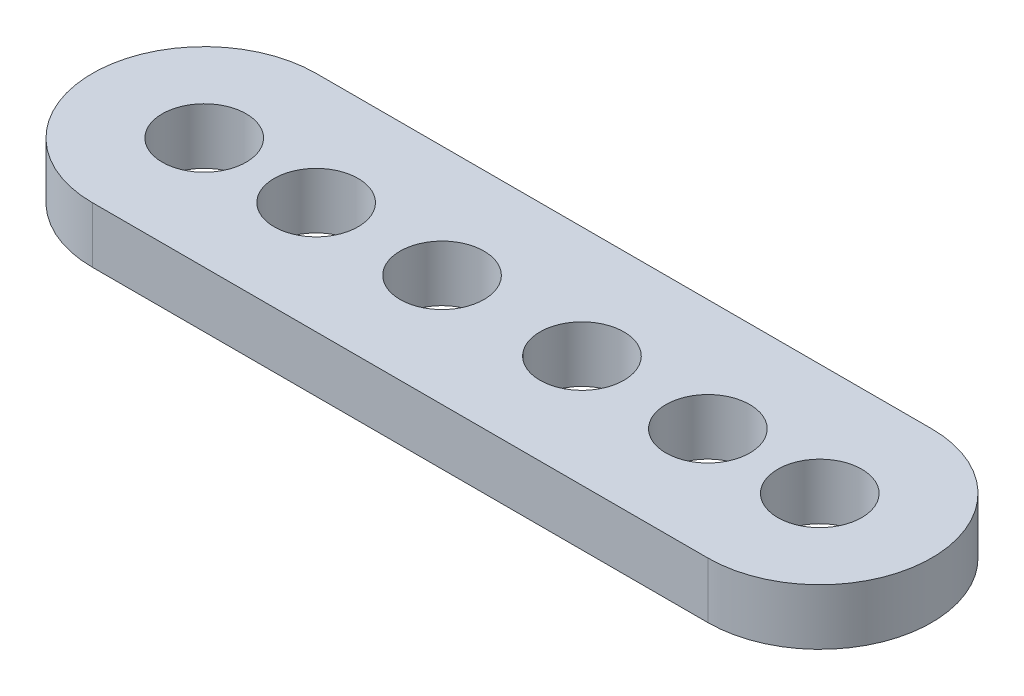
ISO-10303-21;
HEADER;
FILE_DESCRIPTION(('STEP AP214'),'2;1');
FILE_NAME('part.step','',(''),(''),'','','');
FILE_SCHEMA(('AUTOMOTIVE_DESIGN { 1 0 10303 214 1 1 1 1 }'));
ENDSEC;
DATA;
#1=APPLICATION_CONTEXT('core data for automotive mechanical design processes');
#2=APPLICATION_PROTOCOL_DEFINITION('international standard','automotive_design',2000,#1);
#3=PRODUCT_CONTEXT('',#1,'mechanical');
#4=PRODUCT('Part','Part','',(#3));
#5=PRODUCT_RELATED_PRODUCT_CATEGORY('part','',(#4));
#6=PRODUCT_DEFINITION_FORMATION('','',#4);
#7=PRODUCT_DEFINITION_CONTEXT('part definition',#1,'design');
#8=PRODUCT_DEFINITION('design','',#6,#7);
#9=PRODUCT_DEFINITION_SHAPE('','',#8);
#10=(LENGTH_UNIT() NAMED_UNIT(*) SI_UNIT(.MILLI.,.METRE.));
#11=(NAMED_UNIT(*) PLANE_ANGLE_UNIT() SI_UNIT($,.RADIAN.));
#12=(NAMED_UNIT(*) SI_UNIT($,.STERADIAN.) SOLID_ANGLE_UNIT());
#13=UNCERTAINTY_MEASURE_WITH_UNIT(LENGTH_MEASURE(1.E-05),#10,'distance_accuracy_value','');
#14=(GEOMETRIC_REPRESENTATION_CONTEXT(3) GLOBAL_UNCERTAINTY_ASSIGNED_CONTEXT((#13)) GLOBAL_UNIT_ASSIGNED_CONTEXT((#10,
#11,#12)) REPRESENTATION_CONTEXT('',''));
#15=CARTESIAN_POINT('',(0.,0.,0.));
#16=DIRECTION('',(0.,0.,1.));
#17=DIRECTION('',(1.,0.,0.));
#18=AXIS2_PLACEMENT_3D('',#15,#16,#17);
#19=CARTESIAN_POINT('',(0.,2.,0.));
#20=DIRECTION('',(0.,1.,0.));
#21=DIRECTION('',(0.,0.,1.));
#22=AXIS2_PLACEMENT_3D('',#19,#20,#21);
#23=PLANE('',#22);
#24=CARTESIAN_POINT('',(18.,2.,0.));
#25=DIRECTION('',(0.,1.,0.));
#26=DIRECTION('',(0.,0.,1.));
#27=AXIS2_PLACEMENT_3D('',#24,#25,#26);
#28=CIRCLE('',#27,1.5);
#29=CARTESIAN_POINT('',(18.,2.,1.5));
#30=VERTEX_POINT('',#29);
#31=EDGE_CURVE('E133',#30,#30,#28,.T.);
#32=ORIENTED_EDGE('',*,*,#31,.F.);
#33=EDGE_LOOP('',(#32));
#34=FACE_BOUND('',#33,.T.);
#35=CARTESIAN_POINT('',(8.5,2.,0.));
#36=DIRECTION('',(0.,1.,0.));
#37=DIRECTION('',(0.,0.,1.));
#38=AXIS2_PLACEMENT_3D('',#35,#36,#37);
#39=CIRCLE('',#38,1.5);
#40=CARTESIAN_POINT('',(8.5,2.,1.5));
#41=VERTEX_POINT('',#40);
#42=EDGE_CURVE('E121',#41,#41,#39,.T.);
#43=ORIENTED_EDGE('',*,*,#42,.F.);
#44=EDGE_LOOP('',(#43));
#45=FACE_BOUND('',#44,.T.);
#46=CARTESIAN_POINT('',(0.,2.,0.));
#47=DIRECTION('',(0.,1.,0.));
#48=DIRECTION('',(0.,0.,1.));
#49=AXIS2_PLACEMENT_3D('',#46,#47,#48);
#50=CIRCLE('',#49,1.5);
#51=CARTESIAN_POINT('',(0.,2.,1.5));
#52=VERTEX_POINT('',#51);
#53=EDGE_CURVE('E100',#52,#52,#50,.T.);
#54=ORIENTED_EDGE('',*,*,#53,.F.);
#55=EDGE_LOOP('',(#54));
#56=FACE_BOUND('',#55,.T.);
#57=CARTESIAN_POINT('',(0.,2.,0.));
#58=DIRECTION('',(0.,1.,0.));
#59=DIRECTION('',(0.,0.,1.));
#60=AXIS2_PLACEMENT_3D('',#57,#58,#59);
#61=CIRCLE('',#60,4.);
#62=CARTESIAN_POINT('',(0.,2.,-4.));
#63=VERTEX_POINT('',#62);
#64=CARTESIAN_POINT('',(0.,2.,4.));
#65=VERTEX_POINT('',#64);
#66=EDGE_CURVE('E85',#63,#65,#61,.T.);
#67=ORIENTED_EDGE('',*,*,#66,.T.);
#68=DIRECTION('',(1.,0.,0.));
#69=VECTOR('',#68,1.);
#70=CARTESIAN_POINT('',(0.,2.,4.));
#71=LINE('',#70,#69);
#72=CARTESIAN_POINT('',(22.,2.,4.));
#73=VERTEX_POINT('',#72);
#74=EDGE_CURVE('E80',#65,#73,#71,.T.);
#75=ORIENTED_EDGE('',*,*,#74,.T.);
#76=CARTESIAN_POINT('',(22.,2.,0.));
#77=DIRECTION('',(0.,1.,0.));
#78=DIRECTION('',(0.,0.,1.));
#79=AXIS2_PLACEMENT_3D('',#76,#77,#78);
#80=CIRCLE('',#79,4.);
#81=CARTESIAN_POINT('',(22.,2.,-4.));
#82=VERTEX_POINT('',#81);
#83=EDGE_CURVE('E83',#73,#82,#80,.T.);
#84=ORIENTED_EDGE('',*,*,#83,.T.);
#85=DIRECTION('',(-1.,0.,0.));
#86=VECTOR('',#85,1.);
#87=CARTESIAN_POINT('',(0.,2.,-4.));
#88=LINE('',#87,#86);
#89=EDGE_CURVE('E50',#82,#63,#88,.T.);
#90=ORIENTED_EDGE('',*,*,#89,.T.);
#91=EDGE_LOOP('',(#67,#75,#84,#90));
#92=FACE_BOUND('',#91,.T.);
#93=CARTESIAN_POINT('',(4.,2.,0.));
#94=DIRECTION('',(0.,1.,0.));
#95=DIRECTION('',(0.,0.,1.));
#96=AXIS2_PLACEMENT_3D('',#93,#94,#95);
#97=CIRCLE('',#96,1.5);
#98=CARTESIAN_POINT('',(4.,2.,1.5));
#99=VERTEX_POINT('',#98);
#100=EDGE_CURVE('E115',#99,#99,#97,.T.);
#101=ORIENTED_EDGE('',*,*,#100,.F.);
#102=EDGE_LOOP('',(#101));
#103=FACE_BOUND('',#102,.T.);
#104=CARTESIAN_POINT('',(13.5,2.,0.));
#105=DIRECTION('',(0.,1.,0.));
#106=DIRECTION('',(0.,0.,1.));
#107=AXIS2_PLACEMENT_3D('',#104,#105,#106);
#108=CIRCLE('',#107,1.5);
#109=CARTESIAN_POINT('',(13.5,2.,1.5));
#110=VERTEX_POINT('',#109);
#111=EDGE_CURVE('E127',#110,#110,#108,.T.);
#112=ORIENTED_EDGE('',*,*,#111,.F.);
#113=EDGE_LOOP('',(#112));
#114=FACE_BOUND('',#113,.T.);
#115=CARTESIAN_POINT('',(22.,2.,0.));
#116=DIRECTION('',(0.,1.,0.));
#117=DIRECTION('',(0.,0.,1.));
#118=AXIS2_PLACEMENT_3D('',#115,#116,#117);
#119=CIRCLE('',#118,1.5);
#120=CARTESIAN_POINT('',(22.,2.,1.5));
#121=VERTEX_POINT('',#120);
#122=EDGE_CURVE('E139',#121,#121,#119,.T.);
#123=ORIENTED_EDGE('',*,*,#122,.F.);
#124=EDGE_LOOP('',(#123));
#125=FACE_BOUND('',#124,.T.);
#126=ADVANCED_FACE('F33',(#34,#45,#56,#92,#103,#114,#125),#23,.T.);
#127=CARTESIAN_POINT('',(0.,0.,0.));
#128=DIRECTION('',(0.,1.,0.));
#129=DIRECTION('',(0.,0.,1.));
#130=AXIS2_PLACEMENT_3D('',#127,#128,#129);
#131=PLANE('',#130);
#132=CARTESIAN_POINT('',(0.,0.,0.));
#133=DIRECTION('',(0.,1.,0.));
#134=DIRECTION('',(0.,0.,1.));
#135=AXIS2_PLACEMENT_3D('',#132,#133,#134);
#136=CIRCLE('',#135,4.);
#137=CARTESIAN_POINT('',(0.,0.,-4.));
#138=VERTEX_POINT('',#137);
#139=CARTESIAN_POINT('',(0.,0.,4.));
#140=VERTEX_POINT('',#139);
#141=EDGE_CURVE('E97',#138,#140,#136,.T.);
#142=ORIENTED_EDGE('',*,*,#141,.F.);
#143=DIRECTION('',(-1.,0.,0.));
#144=VECTOR('',#143,1.);
#145=CARTESIAN_POINT('',(0.,0.,-4.));
#146=LINE('',#145,#144);
#147=CARTESIAN_POINT('',(22.,0.,-4.));
#148=VERTEX_POINT('',#147);
#149=EDGE_CURVE('E73',#148,#138,#146,.T.);
#150=ORIENTED_EDGE('',*,*,#149,.F.);
#151=CARTESIAN_POINT('',(22.,0.,0.));
#152=DIRECTION('',(0.,1.,0.));
#153=DIRECTION('',(0.,0.,1.));
#154=AXIS2_PLACEMENT_3D('',#151,#152,#153);
#155=CIRCLE('',#154,4.);
#156=CARTESIAN_POINT('',(22.,0.,4.));
#157=VERTEX_POINT('',#156);
#158=EDGE_CURVE('E67',#157,#148,#155,.T.);
#159=ORIENTED_EDGE('',*,*,#158,.F.);
#160=DIRECTION('',(1.,0.,0.));
#161=VECTOR('',#160,1.);
#162=CARTESIAN_POINT('',(0.,0.,4.));
#163=LINE('',#162,#161);
#164=EDGE_CURVE('E89',#140,#157,#163,.T.);
#165=ORIENTED_EDGE('',*,*,#164,.F.);
#166=EDGE_LOOP('',(#142,#150,#159,#165));
#167=FACE_BOUND('',#166,.T.);
#168=CARTESIAN_POINT('',(0.,0.,0.));
#169=DIRECTION('',(0.,1.,0.));
#170=DIRECTION('',(0.,0.,1.));
#171=AXIS2_PLACEMENT_3D('',#168,#169,#170);
#172=CIRCLE('',#171,1.5);
#173=CARTESIAN_POINT('',(0.,0.,1.5));
#174=VERTEX_POINT('',#173);
#175=EDGE_CURVE('E112',#174,#174,#172,.T.);
#176=ORIENTED_EDGE('',*,*,#175,.T.);
#177=EDGE_LOOP('',(#176));
#178=FACE_BOUND('',#177,.T.);
#179=CARTESIAN_POINT('',(4.,0.,0.));
#180=DIRECTION('',(0.,1.,0.));
#181=DIRECTION('',(0.,0.,1.));
#182=AXIS2_PLACEMENT_3D('',#179,#180,#181);
#183=CIRCLE('',#182,1.5);
#184=CARTESIAN_POINT('',(4.,0.,1.5));
#185=VERTEX_POINT('',#184);
#186=EDGE_CURVE('E118',#185,#185,#183,.T.);
#187=ORIENTED_EDGE('',*,*,#186,.T.);
#188=EDGE_LOOP('',(#187));
#189=FACE_BOUND('',#188,.T.);
#190=CARTESIAN_POINT('',(8.5,0.,0.));
#191=DIRECTION('',(0.,1.,0.));
#192=DIRECTION('',(0.,0.,1.));
#193=AXIS2_PLACEMENT_3D('',#190,#191,#192);
#194=CIRCLE('',#193,1.5);
#195=CARTESIAN_POINT('',(8.5,0.,1.5));
#196=VERTEX_POINT('',#195);
#197=EDGE_CURVE('E124',#196,#196,#194,.T.);
#198=ORIENTED_EDGE('',*,*,#197,.T.);
#199=EDGE_LOOP('',(#198));
#200=FACE_BOUND('',#199,.T.);
#201=CARTESIAN_POINT('',(13.5,0.,0.));
#202=DIRECTION('',(0.,1.,0.));
#203=DIRECTION('',(0.,0.,1.));
#204=AXIS2_PLACEMENT_3D('',#201,#202,#203);
#205=CIRCLE('',#204,1.5);
#206=CARTESIAN_POINT('',(13.5,0.,1.5));
#207=VERTEX_POINT('',#206);
#208=EDGE_CURVE('E130',#207,#207,#205,.T.);
#209=ORIENTED_EDGE('',*,*,#208,.T.);
#210=EDGE_LOOP('',(#209));
#211=FACE_BOUND('',#210,.T.);
#212=CARTESIAN_POINT('',(18.,0.,0.));
#213=DIRECTION('',(0.,1.,0.));
#214=DIRECTION('',(0.,0.,1.));
#215=AXIS2_PLACEMENT_3D('',#212,#213,#214);
#216=CIRCLE('',#215,1.5);
#217=CARTESIAN_POINT('',(18.,0.,1.5));
#218=VERTEX_POINT('',#217);
#219=EDGE_CURVE('E136',#218,#218,#216,.T.);
#220=ORIENTED_EDGE('',*,*,#219,.T.);
#221=EDGE_LOOP('',(#220));
#222=FACE_BOUND('',#221,.T.);
#223=CARTESIAN_POINT('',(22.,0.,0.));
#224=DIRECTION('',(0.,1.,0.));
#225=DIRECTION('',(0.,0.,1.));
#226=AXIS2_PLACEMENT_3D('',#223,#224,#225);
#227=CIRCLE('',#226,1.5);
#228=CARTESIAN_POINT('',(22.,0.,1.5));
#229=VERTEX_POINT('',#228);
#230=EDGE_CURVE('E142',#229,#229,#227,.T.);
#231=ORIENTED_EDGE('',*,*,#230,.T.);
#232=EDGE_LOOP('',(#231));
#233=FACE_BOUND('',#232,.T.);
#234=ADVANCED_FACE('F108',(#167,#178,#189,#200,#211,#222,#233),#131,.F.);
#235=CARTESIAN_POINT('',(0.,2.,0.));
#236=DIRECTION('',(0.,-1.,0.));
#237=DIRECTION('',(0.,0.,-1.));
#238=AXIS2_PLACEMENT_3D('',#235,#236,#237);
#239=CYLINDRICAL_SURFACE('',#238,4.);
#240=ORIENTED_EDGE('',*,*,#141,.T.);
#241=DIRECTION('',(0.,-1.,0.));
#242=VECTOR('',#241,1.);
#243=CARTESIAN_POINT('',(0.,2.,4.));
#244=LINE('',#243,#242);
#245=EDGE_CURVE('E11',#65,#140,#244,.T.);
#246=ORIENTED_EDGE('',*,*,#245,.F.);
#247=ORIENTED_EDGE('',*,*,#66,.F.);
#248=DIRECTION('',(0.,-1.,0.));
#249=VECTOR('',#248,1.);
#250=CARTESIAN_POINT('',(0.,2.,-4.));
#251=LINE('',#250,#249);
#252=EDGE_CURVE('E93',#63,#138,#251,.T.);
#253=ORIENTED_EDGE('',*,*,#252,.T.);
#254=EDGE_LOOP('',(#240,#246,#247,#253));
#255=FACE_BOUND('',#254,.T.);
#256=ADVANCED_FACE('F35',(#255),#239,.T.);
#257=CARTESIAN_POINT('',(0.,2.,4.));
#258=DIRECTION('',(0.,0.,-1.));
#259=DIRECTION('',(-1.,0.,0.));
#260=AXIS2_PLACEMENT_3D('',#257,#258,#259);
#261=PLANE('',#260);
#262=ORIENTED_EDGE('',*,*,#164,.T.);
#263=DIRECTION('',(0.,-1.,0.));
#264=VECTOR('',#263,1.);
#265=CARTESIAN_POINT('',(22.,2.,4.));
#266=LINE('',#265,#264);
#267=EDGE_CURVE('E42',#73,#157,#266,.T.);
#268=ORIENTED_EDGE('',*,*,#267,.F.);
#269=ORIENTED_EDGE('',*,*,#74,.F.);
#270=ORIENTED_EDGE('',*,*,#245,.T.);
#271=EDGE_LOOP('',(#262,#268,#269,#270));
#272=FACE_BOUND('',#271,.T.);
#273=ADVANCED_FACE('F88',(#272),#261,.F.);
#274=CARTESIAN_POINT('',(22.,2.,0.));
#275=DIRECTION('',(0.,-1.,0.));
#276=DIRECTION('',(0.,0.,-1.));
#277=AXIS2_PLACEMENT_3D('',#274,#275,#276);
#278=CYLINDRICAL_SURFACE('',#277,4.);
#279=ORIENTED_EDGE('',*,*,#158,.T.);
#280=DIRECTION('',(0.,-1.,0.));
#281=VECTOR('',#280,1.);
#282=CARTESIAN_POINT('',(22.,2.,-4.));
#283=LINE('',#282,#281);
#284=EDGE_CURVE('E90',#82,#148,#283,.T.);
#285=ORIENTED_EDGE('',*,*,#284,.F.);
#286=ORIENTED_EDGE('',*,*,#83,.F.);
#287=ORIENTED_EDGE('',*,*,#267,.T.);
#288=EDGE_LOOP('',(#279,#285,#286,#287));
#289=FACE_BOUND('',#288,.T.);
#290=ADVANCED_FACE('F91',(#289),#278,.T.);
#291=CARTESIAN_POINT('',(0.,2.,-4.));
#292=DIRECTION('',(0.,0.,1.));
#293=DIRECTION('',(1.,0.,0.));
#294=AXIS2_PLACEMENT_3D('',#291,#292,#293);
#295=PLANE('',#294);
#296=ORIENTED_EDGE('',*,*,#149,.T.);
#297=ORIENTED_EDGE('',*,*,#252,.F.);
#298=ORIENTED_EDGE('',*,*,#89,.F.);
#299=ORIENTED_EDGE('',*,*,#284,.T.);
#300=EDGE_LOOP('',(#296,#297,#298,#299));
#301=FACE_BOUND('',#300,.T.);
#302=ADVANCED_FACE('F105',(#301),#295,.F.);
#303=CARTESIAN_POINT('',(0.,2.,0.));
#304=DIRECTION('',(0.,-1.,0.));
#305=DIRECTION('',(0.,0.,-1.));
#306=AXIS2_PLACEMENT_3D('',#303,#304,#305);
#307=CYLINDRICAL_SURFACE('',#306,1.5);
#308=ORIENTED_EDGE('',*,*,#53,.T.);
#309=EDGE_LOOP('',(#308));
#310=FACE_BOUND('',#309,.T.);
#311=ORIENTED_EDGE('',*,*,#175,.F.);
#312=EDGE_LOOP('',(#311));
#313=FACE_BOUND('',#312,.T.);
#314=ADVANCED_FACE('F161',(#310,#313),#307,.F.);
#315=CARTESIAN_POINT('',(4.,2.,0.));
#316=DIRECTION('',(0.,-1.,0.));
#317=DIRECTION('',(0.,0.,-1.));
#318=AXIS2_PLACEMENT_3D('',#315,#316,#317);
#319=CYLINDRICAL_SURFACE('',#318,1.5);
#320=ORIENTED_EDGE('',*,*,#100,.T.);
#321=EDGE_LOOP('',(#320));
#322=FACE_BOUND('',#321,.T.);
#323=ORIENTED_EDGE('',*,*,#186,.F.);
#324=EDGE_LOOP('',(#323));
#325=FACE_BOUND('',#324,.T.);
#326=ADVANCED_FACE('F207',(#322,#325),#319,.F.);
#327=CARTESIAN_POINT('',(8.5,2.,0.));
#328=DIRECTION('',(0.,-1.,0.));
#329=DIRECTION('',(0.,0.,-1.));
#330=AXIS2_PLACEMENT_3D('',#327,#328,#329);
#331=CYLINDRICAL_SURFACE('',#330,1.5);
#332=ORIENTED_EDGE('',*,*,#42,.T.);
#333=EDGE_LOOP('',(#332));
#334=FACE_BOUND('',#333,.T.);
#335=ORIENTED_EDGE('',*,*,#197,.F.);
#336=EDGE_LOOP('',(#335));
#337=FACE_BOUND('',#336,.T.);
#338=ADVANCED_FACE('F215',(#334,#337),#331,.F.);
#339=CARTESIAN_POINT('',(13.5,2.,0.));
#340=DIRECTION('',(0.,-1.,0.));
#341=DIRECTION('',(0.,0.,-1.));
#342=AXIS2_PLACEMENT_3D('',#339,#340,#341);
#343=CYLINDRICAL_SURFACE('',#342,1.5);
#344=ORIENTED_EDGE('',*,*,#111,.T.);
#345=EDGE_LOOP('',(#344));
#346=FACE_BOUND('',#345,.T.);
#347=ORIENTED_EDGE('',*,*,#208,.F.);
#348=EDGE_LOOP('',(#347));
#349=FACE_BOUND('',#348,.T.);
#350=ADVANCED_FACE('F223',(#346,#349),#343,.F.);
#351=CARTESIAN_POINT('',(18.,2.,0.));
#352=DIRECTION('',(0.,-1.,0.));
#353=DIRECTION('',(0.,0.,-1.));
#354=AXIS2_PLACEMENT_3D('',#351,#352,#353);
#355=CYLINDRICAL_SURFACE('',#354,1.5);
#356=ORIENTED_EDGE('',*,*,#31,.T.);
#357=EDGE_LOOP('',(#356));
#358=FACE_BOUND('',#357,.T.);
#359=ORIENTED_EDGE('',*,*,#219,.F.);
#360=EDGE_LOOP('',(#359));
#361=FACE_BOUND('',#360,.T.);
#362=ADVANCED_FACE('F232',(#358,#361),#355,.F.);
#363=CARTESIAN_POINT('',(22.,2.,0.));
#364=DIRECTION('',(0.,-1.,0.));
#365=DIRECTION('',(0.,0.,-1.));
#366=AXIS2_PLACEMENT_3D('',#363,#364,#365);
#367=CYLINDRICAL_SURFACE('',#366,1.5);
#368=ORIENTED_EDGE('',*,*,#122,.T.);
#369=EDGE_LOOP('',(#368));
#370=FACE_BOUND('',#369,.T.);
#371=ORIENTED_EDGE('',*,*,#230,.F.);
#372=EDGE_LOOP('',(#371));
#373=FACE_BOUND('',#372,.T.);
#374=ADVANCED_FACE('F148',(#370,#373),#367,.F.);
#375=CLOSED_SHELL('',(#126,#234,#256,#273,#290,#302,#314,#326,#338,#350,#362,#374));
#376=MANIFOLD_SOLID_BREP('B2',#375);
#377=ADVANCED_BREP_SHAPE_REPRESENTATION('',(#18,#376),#14);
#378=SHAPE_DEFINITION_REPRESENTATION(#9,#377);
ENDSEC;
END-ISO-10303-21;
